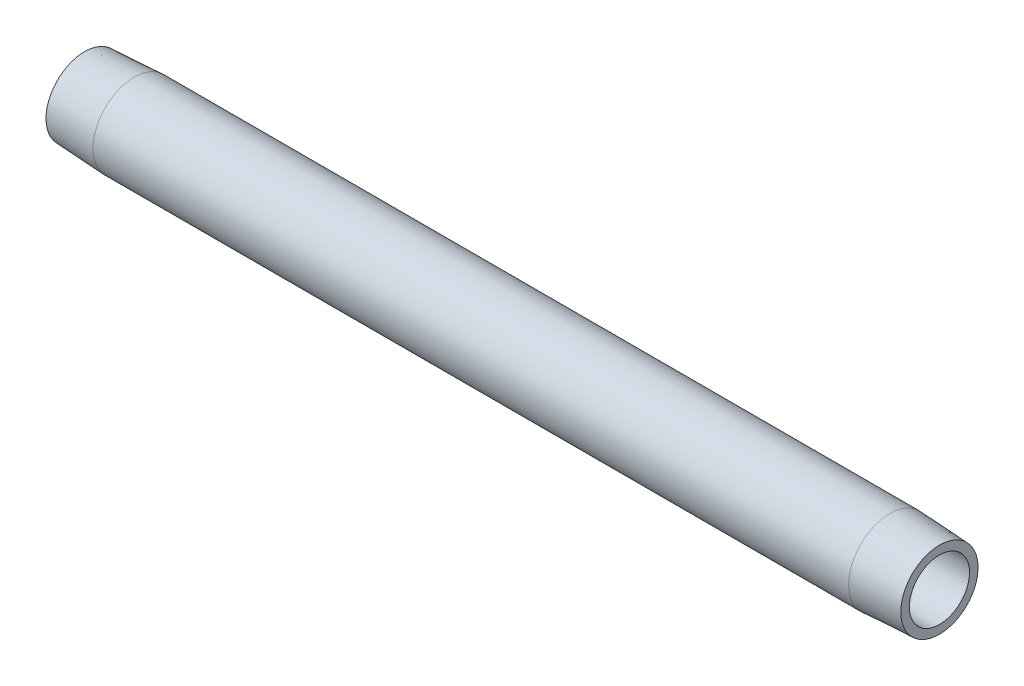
ISO-10303-21;
HEADER;
FILE_DESCRIPTION(('STEP AP214'),'2;1');
FILE_NAME('part.step','',(''),(''),'','','');
FILE_SCHEMA(('AUTOMOTIVE_DESIGN { 1 0 10303 214 1 1 1 1 }'));
ENDSEC;
DATA;
#1=APPLICATION_CONTEXT('core data for automotive mechanical design processes');
#2=APPLICATION_PROTOCOL_DEFINITION('international standard','automotive_design',2000,#1);
#3=PRODUCT_CONTEXT('',#1,'mechanical');
#4=PRODUCT('Part','Part','',(#3));
#5=PRODUCT_RELATED_PRODUCT_CATEGORY('part','',(#4));
#6=PRODUCT_DEFINITION_FORMATION('','',#4);
#7=PRODUCT_DEFINITION_CONTEXT('part definition',#1,'design');
#8=PRODUCT_DEFINITION('design','',#6,#7);
#9=PRODUCT_DEFINITION_SHAPE('','',#8);
#10=(LENGTH_UNIT() NAMED_UNIT(*) SI_UNIT(.MILLI.,.METRE.));
#11=(NAMED_UNIT(*) PLANE_ANGLE_UNIT() SI_UNIT($,.RADIAN.));
#12=(NAMED_UNIT(*) SI_UNIT($,.STERADIAN.) SOLID_ANGLE_UNIT());
#13=UNCERTAINTY_MEASURE_WITH_UNIT(LENGTH_MEASURE(1.E-05),#10,'distance_accuracy_value','');
#14=(GEOMETRIC_REPRESENTATION_CONTEXT(3) GLOBAL_UNCERTAINTY_ASSIGNED_CONTEXT((#13)) GLOBAL_UNIT_ASSIGNED_CONTEXT((#10,
#11,#12)) REPRESENTATION_CONTEXT('',''));
#15=CARTESIAN_POINT('',(0.,0.,0.));
#16=DIRECTION('',(0.,0.,1.));
#17=DIRECTION('',(1.,0.,0.));
#18=AXIS2_PLACEMENT_3D('',#15,#16,#17);
#19=CARTESIAN_POINT('',(177.8,6.26110000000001,0.));
#20=DIRECTION('',(-1.,0.,0.));
#21=DIRECTION('',(0.,0.,1.));
#22=AXIS2_PLACEMENT_3D('',#19,#20,#21);
#23=PLANE('',#22);
#24=CARTESIAN_POINT('',(177.8,0.,0.));
#25=DIRECTION('',(-1.,0.,0.));
#26=DIRECTION('',(0.,0.,1.));
#27=AXIS2_PLACEMENT_3D('',#24,#25,#26);
#28=CIRCLE('',#27,8.03205001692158);
#29=CARTESIAN_POINT('',(177.8,0.,8.03205001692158));
#30=VERTEX_POINT('',#29);
#31=EDGE_CURVE('E10',#30,#30,#28,.T.);
#32=ORIENTED_EDGE('',*,*,#31,.F.);
#33=EDGE_LOOP('',(#32));
#34=FACE_BOUND('',#33,.T.);
#35=CARTESIAN_POINT('',(177.8,0.,0.));
#36=DIRECTION('',(-1.,0.,0.));
#37=DIRECTION('',(0.,0.,1.));
#38=AXIS2_PLACEMENT_3D('',#35,#36,#37);
#39=CIRCLE('',#38,6.26110000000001);
#40=CARTESIAN_POINT('',(177.8,0.,6.26110000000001));
#41=VERTEX_POINT('',#40);
#42=EDGE_CURVE('E52',#41,#41,#39,.T.);
#43=ORIENTED_EDGE('',*,*,#42,.T.);
#44=EDGE_LOOP('',(#43));
#45=FACE_BOUND('',#44,.T.);
#46=ADVANCED_FACE('F30',(#34,#45),#23,.F.);
#47=CARTESIAN_POINT('',(177.8,0.,0.));
#48=DIRECTION('',(-1.,0.,0.));
#49=DIRECTION('',(0.,0.,1.));
#50=AXIS2_PLACEMENT_3D('',#47,#48,#49);
#51=CONICAL_SURFACE('',#50,8.03205001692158,0.0523598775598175);
#52=CARTESIAN_POINT('',(167.4876,0.,0.));
#53=DIRECTION('',(-1.,0.,0.));
#54=DIRECTION('',(0.,0.,1.));
#55=AXIS2_PLACEMENT_3D('',#52,#53,#54);
#56=CIRCLE('',#55,8.57249999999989);
#57=CARTESIAN_POINT('',(167.4876,0.,8.57249999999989));
#58=VERTEX_POINT('',#57);
#59=EDGE_CURVE('E36',#58,#58,#56,.T.);
#60=ORIENTED_EDGE('',*,*,#59,.F.);
#61=EDGE_LOOP('',(#60));
#62=FACE_BOUND('',#61,.T.);
#63=ORIENTED_EDGE('',*,*,#31,.T.);
#64=EDGE_LOOP('',(#63));
#65=FACE_BOUND('',#64,.T.);
#66=ADVANCED_FACE('F77',(#62,#65),#51,.T.);
#67=CARTESIAN_POINT('',(0.,0.,0.));
#68=DIRECTION('',(-1.,0.,0.));
#69=DIRECTION('',(0.,0.,1.));
#70=AXIS2_PLACEMENT_3D('',#67,#68,#69);
#71=CYLINDRICAL_SURFACE('',#70,8.57249999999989);
#72=CARTESIAN_POINT('',(10.3124,0.,0.));
#73=DIRECTION('',(-1.,0.,0.));
#74=DIRECTION('',(0.,0.,1.));
#75=AXIS2_PLACEMENT_3D('',#72,#73,#74);
#76=CIRCLE('',#75,8.57249999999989);
#77=CARTESIAN_POINT('',(10.3124,0.,8.57249999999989));
#78=VERTEX_POINT('',#77);
#79=EDGE_CURVE('E40',#78,#78,#76,.T.);
#80=ORIENTED_EDGE('',*,*,#79,.F.);
#81=EDGE_LOOP('',(#80));
#82=FACE_BOUND('',#81,.T.);
#83=ORIENTED_EDGE('',*,*,#59,.T.);
#84=EDGE_LOOP('',(#83));
#85=FACE_BOUND('',#84,.T.);
#86=ADVANCED_FACE('F72',(#82,#85),#71,.T.);
#87=CARTESIAN_POINT('',(10.3124,0.,0.));
#88=DIRECTION('',(1.,0.,0.));
#89=DIRECTION('',(0.,0.,-1.));
#90=AXIS2_PLACEMENT_3D('',#87,#88,#89);
#91=CONICAL_SURFACE('',#90,8.57249999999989,0.0523598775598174);
#92=CARTESIAN_POINT('',(0.,0.,0.));
#93=DIRECTION('',(-1.,0.,0.));
#94=DIRECTION('',(0.,0.,1.));
#95=AXIS2_PLACEMENT_3D('',#92,#93,#94);
#96=CIRCLE('',#95,8.03205001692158);
#97=CARTESIAN_POINT('',(0.,0.,8.03205001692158));
#98=VERTEX_POINT('',#97);
#99=EDGE_CURVE('E44',#98,#98,#96,.T.);
#100=ORIENTED_EDGE('',*,*,#99,.F.);
#101=EDGE_LOOP('',(#100));
#102=FACE_BOUND('',#101,.T.);
#103=ORIENTED_EDGE('',*,*,#79,.T.);
#104=EDGE_LOOP('',(#103));
#105=FACE_BOUND('',#104,.T.);
#106=ADVANCED_FACE('F66',(#102,#105),#91,.T.);
#107=CARTESIAN_POINT('',(0.,6.26110000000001,0.));
#108=DIRECTION('',(1.,0.,0.));
#109=DIRECTION('',(0.,0.,-1.));
#110=AXIS2_PLACEMENT_3D('',#107,#108,#109);
#111=PLANE('',#110);
#112=CARTESIAN_POINT('',(0.,0.,0.));
#113=DIRECTION('',(-1.,0.,0.));
#114=DIRECTION('',(0.,0.,1.));
#115=AXIS2_PLACEMENT_3D('',#112,#113,#114);
#116=CIRCLE('',#115,6.26110000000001);
#117=CARTESIAN_POINT('',(0.,0.,6.26110000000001));
#118=VERTEX_POINT('',#117);
#119=EDGE_CURVE('E49',#118,#118,#116,.T.);
#120=ORIENTED_EDGE('',*,*,#119,.F.);
#121=EDGE_LOOP('',(#120));
#122=FACE_BOUND('',#121,.T.);
#123=ORIENTED_EDGE('',*,*,#99,.T.);
#124=EDGE_LOOP('',(#123));
#125=FACE_BOUND('',#124,.T.);
#126=ADVANCED_FACE('F60',(#122,#125),#111,.F.);
#127=CARTESIAN_POINT('',(0.,0.,0.));
#128=DIRECTION('',(-1.,0.,0.));
#129=DIRECTION('',(0.,0.,1.));
#130=AXIS2_PLACEMENT_3D('',#127,#128,#129);
#131=CYLINDRICAL_SURFACE('',#130,6.26110000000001);
#132=ORIENTED_EDGE('',*,*,#42,.F.);
#133=EDGE_LOOP('',(#132));
#134=FACE_BOUND('',#133,.T.);
#135=ORIENTED_EDGE('',*,*,#119,.T.);
#136=EDGE_LOOP('',(#135));
#137=FACE_BOUND('',#136,.T.);
#138=ADVANCED_FACE('F57',(#134,#137),#131,.F.);
#139=CLOSED_SHELL('',(#46,#66,#86,#106,#126,#138));
#140=MANIFOLD_SOLID_BREP('B2',#139);
#141=ADVANCED_BREP_SHAPE_REPRESENTATION('',(#18,#140),#14);
#142=SHAPE_DEFINITION_REPRESENTATION(#9,#141);
ENDSEC;
END-ISO-10303-21;
